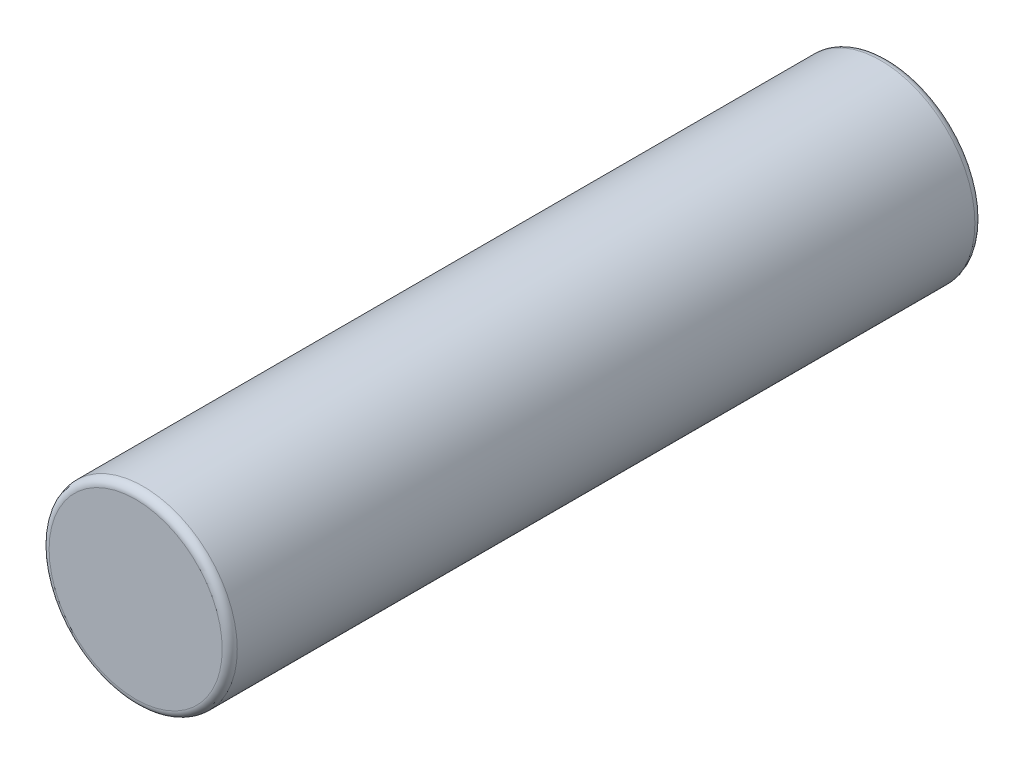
ISO-10303-21;
HEADER;
FILE_DESCRIPTION(('STEP AP214'),'2;1');
FILE_NAME('part.step','',(''),(''),'','','');
FILE_SCHEMA(('AUTOMOTIVE_DESIGN { 1 0 10303 214 1 1 1 1 }'));
ENDSEC;
DATA;
#1=APPLICATION_CONTEXT('core data for automotive mechanical design processes');
#2=APPLICATION_PROTOCOL_DEFINITION('international standard','automotive_design',2000,#1);
#3=PRODUCT_CONTEXT('',#1,'mechanical');
#4=PRODUCT('Part','Part','',(#3));
#5=PRODUCT_RELATED_PRODUCT_CATEGORY('part','',(#4));
#6=PRODUCT_DEFINITION_FORMATION('','',#4);
#7=PRODUCT_DEFINITION_CONTEXT('part definition',#1,'design');
#8=PRODUCT_DEFINITION('design','',#6,#7);
#9=PRODUCT_DEFINITION_SHAPE('','',#8);
#10=(LENGTH_UNIT() NAMED_UNIT(*) SI_UNIT(.MILLI.,.METRE.));
#11=(NAMED_UNIT(*) PLANE_ANGLE_UNIT() SI_UNIT($,.RADIAN.));
#12=(NAMED_UNIT(*) SI_UNIT($,.STERADIAN.) SOLID_ANGLE_UNIT());
#13=UNCERTAINTY_MEASURE_WITH_UNIT(LENGTH_MEASURE(1.E-05),#10,'distance_accuracy_value','');
#14=(GEOMETRIC_REPRESENTATION_CONTEXT(3) GLOBAL_UNCERTAINTY_ASSIGNED_CONTEXT((#13)) GLOBAL_UNIT_ASSIGNED_CONTEXT((#10,
#11,#12)) REPRESENTATION_CONTEXT('',''));
#15=CARTESIAN_POINT('',(0.,0.,0.));
#16=DIRECTION('',(0.,0.,1.));
#17=DIRECTION('',(1.,0.,0.));
#18=AXIS2_PLACEMENT_3D('',#15,#16,#17);
#19=CARTESIAN_POINT('',(0.,0.,10.));
#20=DIRECTION('',(0.,0.,-1.));
#21=DIRECTION('',(-1.,0.,0.));
#22=AXIS2_PLACEMENT_3D('',#19,#20,#21);
#23=CYLINDRICAL_SURFACE('',#22,2.5);
#24=CARTESIAN_POINT('',(0.,0.,-9.8));
#25=DIRECTION('',(0.,0.,1.));
#26=DIRECTION('',(1.,0.,0.));
#27=AXIS2_PLACEMENT_3D('',#24,#25,#26);
#28=CIRCLE('',#27,2.5);
#29=CARTESIAN_POINT('',(2.5,0.,-9.8));
#30=VERTEX_POINT('',#29);
#31=EDGE_CURVE('E41',#30,#30,#28,.T.);
#32=ORIENTED_EDGE('',*,*,#31,.T.);
#33=EDGE_LOOP('',(#32));
#34=FACE_BOUND('',#33,.T.);
#35=CARTESIAN_POINT('',(0.,0.,9.8));
#36=DIRECTION('',(0.,0.,1.));
#37=DIRECTION('',(1.,0.,0.));
#38=AXIS2_PLACEMENT_3D('',#35,#36,#37);
#39=CIRCLE('',#38,2.5);
#40=CARTESIAN_POINT('',(2.5,0.,9.8));
#41=VERTEX_POINT('',#40);
#42=EDGE_CURVE('E45',#41,#41,#39,.F.);
#43=ORIENTED_EDGE('',*,*,#42,.T.);
#44=EDGE_LOOP('',(#43));
#45=FACE_BOUND('',#44,.T.);
#46=ADVANCED_FACE('F31',(#34,#45),#23,.T.);
#47=CARTESIAN_POINT('',(0.,0.,10.));
#48=DIRECTION('',(0.,0.,1.));
#49=DIRECTION('',(1.,0.,0.));
#50=AXIS2_PLACEMENT_3D('',#47,#48,#49);
#51=PLANE('',#50);
#52=CARTESIAN_POINT('',(0.,0.,10.));
#53=DIRECTION('',(0.,0.,1.));
#54=DIRECTION('',(1.,0.,0.));
#55=AXIS2_PLACEMENT_3D('',#52,#53,#54);
#56=CIRCLE('',#55,2.3);
#57=CARTESIAN_POINT('',(2.3,0.,10.));
#58=VERTEX_POINT('',#57);
#59=EDGE_CURVE('E10',#58,#58,#56,.T.);
#60=ORIENTED_EDGE('',*,*,#59,.T.);
#61=EDGE_LOOP('',(#60));
#62=FACE_BOUND('',#61,.T.);
#63=ADVANCED_FACE('F64',(#62),#51,.T.);
#64=CARTESIAN_POINT('',(0.,0.,-10.));
#65=DIRECTION('',(0.,0.,1.));
#66=DIRECTION('',(1.,0.,0.));
#67=AXIS2_PLACEMENT_3D('',#64,#65,#66);
#68=PLANE('',#67);
#69=CARTESIAN_POINT('',(0.,0.,-10.));
#70=DIRECTION('',(0.,0.,1.));
#71=DIRECTION('',(1.,0.,0.));
#72=AXIS2_PLACEMENT_3D('',#69,#70,#71);
#73=CIRCLE('',#72,2.3);
#74=CARTESIAN_POINT('',(2.3,0.,-10.));
#75=VERTEX_POINT('',#74);
#76=EDGE_CURVE('E37',#75,#75,#73,.F.);
#77=ORIENTED_EDGE('',*,*,#76,.T.);
#78=EDGE_LOOP('',(#77));
#79=FACE_BOUND('',#78,.T.);
#80=ADVANCED_FACE('F60',(#79),#68,.F.);
#81=CARTESIAN_POINT('',(0.,0.,-9.8));
#82=DIRECTION('',(0.,0.,1.));
#83=DIRECTION('',(1.,0.,0.));
#84=AXIS2_PLACEMENT_3D('',#81,#82,#83);
#85=TOROIDAL_SURFACE('',#84,2.3,0.2);
#86=ORIENTED_EDGE('',*,*,#76,.F.);
#87=EDGE_LOOP('',(#86));
#88=FACE_BOUND('',#87,.T.);
#89=ORIENTED_EDGE('',*,*,#31,.F.);
#90=EDGE_LOOP('',(#89));
#91=FACE_BOUND('',#90,.T.);
#92=ADVANCED_FACE('F55',(#88,#91),#85,.T.);
#93=CARTESIAN_POINT('',(0.,0.,9.8));
#94=DIRECTION('',(0.,0.,1.));
#95=DIRECTION('',(1.,0.,0.));
#96=AXIS2_PLACEMENT_3D('',#93,#94,#95);
#97=TOROIDAL_SURFACE('',#96,2.3,0.2);
#98=ORIENTED_EDGE('',*,*,#42,.F.);
#99=EDGE_LOOP('',(#98));
#100=FACE_BOUND('',#99,.T.);
#101=ORIENTED_EDGE('',*,*,#59,.F.);
#102=EDGE_LOOP('',(#101));
#103=FACE_BOUND('',#102,.T.);
#104=ADVANCED_FACE('F52',(#100,#103),#97,.T.);
#105=CLOSED_SHELL('',(#46,#63,#80,#92,#104));
#106=MANIFOLD_SOLID_BREP('B2',#105);
#107=ADVANCED_BREP_SHAPE_REPRESENTATION('',(#18,#106),#14);
#108=SHAPE_DEFINITION_REPRESENTATION(#9,#107);
ENDSEC;
END-ISO-10303-21;
